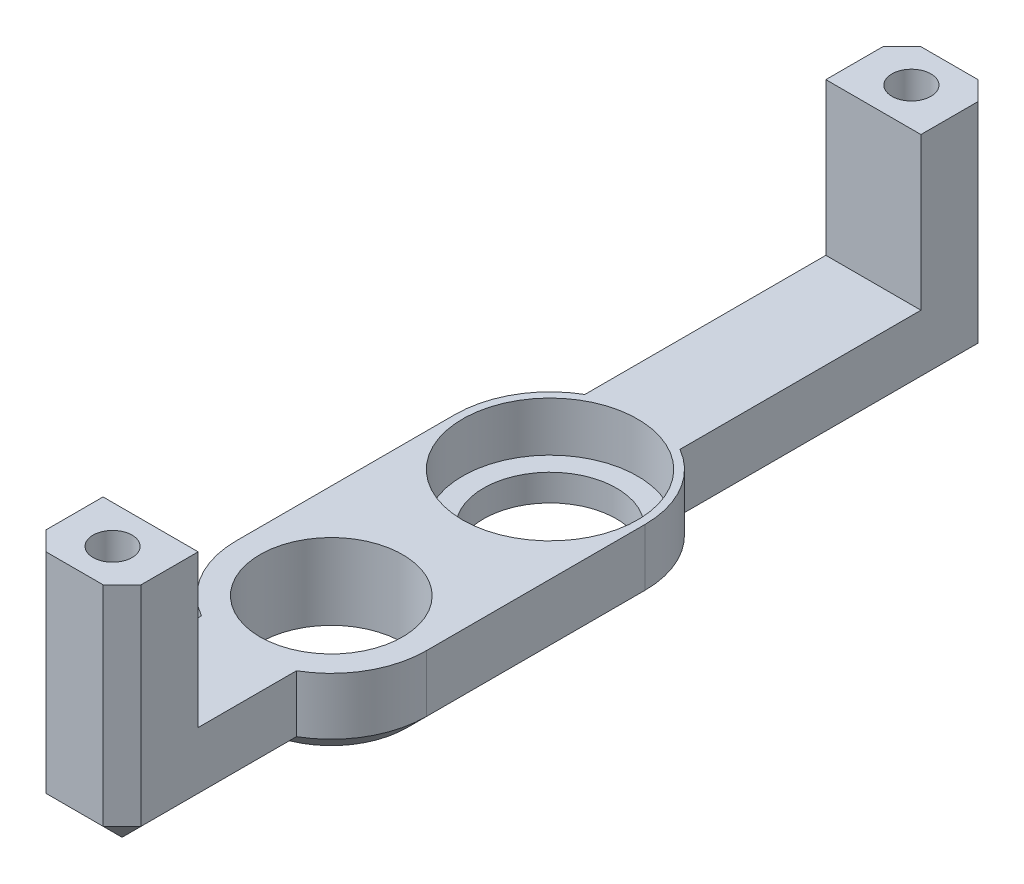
ISO-10303-21;
HEADER;
FILE_DESCRIPTION(('STEP AP214'),'2;1');
FILE_NAME('part.step','',(''),(''),'','','');
FILE_SCHEMA(('AUTOMOTIVE_DESIGN { 1 0 10303 214 1 1 1 1 }'));
ENDSEC;
DATA;
#1=APPLICATION_CONTEXT('core data for automotive mechanical design processes');
#2=APPLICATION_PROTOCOL_DEFINITION('international standard','automotive_design',2000,#1);
#3=PRODUCT_CONTEXT('',#1,'mechanical');
#4=PRODUCT('Part','Part','',(#3));
#5=PRODUCT_RELATED_PRODUCT_CATEGORY('part','',(#4));
#6=PRODUCT_DEFINITION_FORMATION('','',#4);
#7=PRODUCT_DEFINITION_CONTEXT('part definition',#1,'design');
#8=PRODUCT_DEFINITION('design','',#6,#7);
#9=PRODUCT_DEFINITION_SHAPE('','',#8);
#10=(LENGTH_UNIT() NAMED_UNIT(*) SI_UNIT(.MILLI.,.METRE.));
#11=(NAMED_UNIT(*) PLANE_ANGLE_UNIT() SI_UNIT($,.RADIAN.));
#12=(NAMED_UNIT(*) SI_UNIT($,.STERADIAN.) SOLID_ANGLE_UNIT());
#13=UNCERTAINTY_MEASURE_WITH_UNIT(LENGTH_MEASURE(1.E-05),#10,'distance_accuracy_value','');
#14=(GEOMETRIC_REPRESENTATION_CONTEXT(3) GLOBAL_UNCERTAINTY_ASSIGNED_CONTEXT((#13)) GLOBAL_UNIT_ASSIGNED_CONTEXT((#10,
#11,#12)) REPRESENTATION_CONTEXT('',''));
#15=CARTESIAN_POINT('',(0.,0.,0.));
#16=DIRECTION('',(0.,0.,1.));
#17=DIRECTION('',(1.,0.,0.));
#18=AXIS2_PLACEMENT_3D('',#15,#16,#17);
#19=CARTESIAN_POINT('',(0.,4.,0.));
#20=DIRECTION('',(0.,-1.,0.));
#21=DIRECTION('',(0.,0.,-1.));
#22=AXIS2_PLACEMENT_3D('',#19,#20,#21);
#23=PLANE('',#22);
#24=CARTESIAN_POINT('',(5.,4.,-25.));
#25=DIRECTION('',(0.,1.,0.));
#26=DIRECTION('',(0.,0.,1.));
#27=AXIS2_PLACEMENT_3D('',#24,#25,#26);
#28=CIRCLE('',#27,4.6);
#29=CARTESIAN_POINT('',(5.,4.,-20.4));
#30=VERTEX_POINT('',#29);
#31=EDGE_CURVE('E888',#30,#30,#28,.T.);
#32=ORIENTED_EDGE('',*,*,#31,.F.);
#33=EDGE_LOOP('',(#32));
#34=FACE_BOUND('',#33,.T.);
#35=CARTESIAN_POINT('',(5.,4.,-13.5));
#36=DIRECTION('',(0.,1.,0.));
#37=DIRECTION('',(0.,0.,1.));
#38=AXIS2_PLACEMENT_3D('',#35,#36,#37);
#39=CIRCLE('',#38,3.75);
#40=CARTESIAN_POINT('',(5.,4.,-9.75));
#41=VERTEX_POINT('',#40);
#42=EDGE_CURVE('E312',#41,#41,#39,.T.);
#43=ORIENTED_EDGE('',*,*,#42,.F.);
#44=EDGE_LOOP('',(#43));
#45=FACE_BOUND('',#44,.T.);
#46=DIRECTION('',(-1.,0.,0.));
#47=VECTOR('',#46,1.);
#48=CARTESIAN_POINT('',(2.5,4.,-4.));
#49=LINE('',#48,#47);
#50=CARTESIAN_POINT('',(7.5,4.,-4.));
#51=VERTEX_POINT('',#50);
#52=CARTESIAN_POINT('',(2.5,4.,-4.));
#53=VERTEX_POINT('',#52);
#54=EDGE_CURVE('E252',#51,#53,#49,.T.);
#55=ORIENTED_EDGE('',*,*,#54,.F.);
#56=DIRECTION('',(0.,0.,1.));
#57=VECTOR('',#56,1.);
#58=CARTESIAN_POINT('',(7.5,4.,0.));
#59=LINE('',#58,#57);
#60=CARTESIAN_POINT('',(7.5,4.,-9.16987298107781));
#61=VERTEX_POINT('',#60);
#62=EDGE_CURVE('E318',#61,#51,#59,.T.);
#63=ORIENTED_EDGE('',*,*,#62,.F.);
#64=CARTESIAN_POINT('',(5.,4.,-13.5));
#65=DIRECTION('',(0.,-1.,0.));
#66=DIRECTION('',(0.,0.,1.));
#67=AXIS2_PLACEMENT_3D('',#64,#65,#66);
#68=CIRCLE('',#67,5.);
#69=CARTESIAN_POINT('',(10.,4.,-13.5));
#70=VERTEX_POINT('',#69);
#71=EDGE_CURVE('E298',#70,#61,#68,.T.);
#72=ORIENTED_EDGE('',*,*,#71,.F.);
#73=DIRECTION('',(0.,0.,-1.));
#74=VECTOR('',#73,1.);
#75=CARTESIAN_POINT('',(9.99999999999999,4.,-46.));
#76=LINE('',#75,#74);
#77=CARTESIAN_POINT('',(10.,4.,-25.));
#78=VERTEX_POINT('',#77);
#79=EDGE_CURVE('E348',#70,#78,#76,.T.);
#80=ORIENTED_EDGE('',*,*,#79,.T.);
#81=CARTESIAN_POINT('',(5.,4.,-25.));
#82=DIRECTION('',(0.,-1.,0.));
#83=DIRECTION('',(0.,0.,1.));
#84=AXIS2_PLACEMENT_3D('',#81,#82,#83);
#85=CIRCLE('',#84,5.);
#86=CARTESIAN_POINT('',(7.5,4.,-29.3301270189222));
#87=VERTEX_POINT('',#86);
#88=EDGE_CURVE('E339',#87,#78,#85,.T.);
#89=ORIENTED_EDGE('',*,*,#88,.F.);
#90=DIRECTION('',(0.,0.,1.));
#91=VECTOR('',#90,1.);
#92=CARTESIAN_POINT('',(7.49999999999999,4.,-46.));
#93=LINE('',#92,#91);
#94=CARTESIAN_POINT('',(7.49999999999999,4.,-42.));
#95=VERTEX_POINT('',#94);
#96=EDGE_CURVE('E335',#95,#87,#93,.T.);
#97=ORIENTED_EDGE('',*,*,#96,.F.);
#98=DIRECTION('',(1.,0.,0.));
#99=VECTOR('',#98,1.);
#100=CARTESIAN_POINT('',(2.49999999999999,4.,-42.));
#101=LINE('',#100,#99);
#102=CARTESIAN_POINT('',(2.49999999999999,4.,-42.));
#103=VERTEX_POINT('',#102);
#104=EDGE_CURVE('E272',#103,#95,#101,.T.);
#105=ORIENTED_EDGE('',*,*,#104,.F.);
#106=DIRECTION('',(0.,0.,-1.));
#107=VECTOR('',#106,1.);
#108=CARTESIAN_POINT('',(2.49999999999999,4.,-46.));
#109=LINE('',#108,#107);
#110=CARTESIAN_POINT('',(2.49999999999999,4.,-29.3301270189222));
#111=VERTEX_POINT('',#110);
#112=EDGE_CURVE('E354',#111,#103,#109,.T.);
#113=ORIENTED_EDGE('',*,*,#112,.F.);
#114=CARTESIAN_POINT('',(5.,4.,-25.));
#115=DIRECTION('',(0.,-1.,0.));
#116=DIRECTION('',(0.,0.,1.));
#117=AXIS2_PLACEMENT_3D('',#114,#115,#116);
#118=CIRCLE('',#117,5.);
#119=CARTESIAN_POINT('',(0.,4.,-25.));
#120=VERTEX_POINT('',#119);
#121=EDGE_CURVE('E334',#120,#111,#118,.T.);
#122=ORIENTED_EDGE('',*,*,#121,.F.);
#123=DIRECTION('',(0.,0.,1.));
#124=VECTOR('',#123,1.);
#125=CARTESIAN_POINT('',(0.,4.,0.));
#126=LINE('',#125,#124);
#127=CARTESIAN_POINT('',(0.,4.,-13.5));
#128=VERTEX_POINT('',#127);
#129=EDGE_CURVE('E366',#120,#128,#126,.T.);
#130=ORIENTED_EDGE('',*,*,#129,.T.);
#131=CARTESIAN_POINT('',(5.,4.,-13.5));
#132=DIRECTION('',(0.,-1.,0.));
#133=DIRECTION('',(0.,0.,1.));
#134=AXIS2_PLACEMENT_3D('',#131,#132,#133);
#135=CIRCLE('',#134,5.);
#136=CARTESIAN_POINT('',(2.5,4.,-9.16987298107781));
#137=VERTEX_POINT('',#136);
#138=EDGE_CURVE('E299',#137,#128,#135,.T.);
#139=ORIENTED_EDGE('',*,*,#138,.F.);
#140=DIRECTION('',(0.,0.,-1.));
#141=VECTOR('',#140,1.);
#142=CARTESIAN_POINT('',(2.5,4.,0.));
#143=LINE('',#142,#141);
#144=EDGE_CURVE('E303',#53,#137,#143,.T.);
#145=ORIENTED_EDGE('',*,*,#144,.F.);
#146=EDGE_LOOP('',(#55,#63,#72,#80,#89,#97,#105,#113,#122,#130,#139,#145));
#147=FACE_BOUND('',#146,.T.);
#148=ADVANCED_FACE('F41',(#34,#45,#147),#23,.F.);
#149=CARTESIAN_POINT('',(0.,4.,0.));
#150=DIRECTION('',(1.,0.,0.));
#151=DIRECTION('',(0.,0.,-1.));
#152=AXIS2_PLACEMENT_3D('',#149,#150,#151);
#153=PLANE('',#152);
#154=DIRECTION('',(0.,1.,0.));
#155=VECTOR('',#154,1.);
#156=CARTESIAN_POINT('',(0.,0.,-25.));
#157=LINE('',#156,#155);
#158=CARTESIAN_POINT('',(0.,1.,-25.));
#159=VERTEX_POINT('',#158);
#160=EDGE_CURVE('E358',#159,#120,#157,.T.);
#161=ORIENTED_EDGE('',*,*,#160,.F.);
#162=DIRECTION('',(0.,0.,1.));
#163=VECTOR('',#162,1.);
#164=CARTESIAN_POINT('',(0.,0.999999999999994,-13.5));
#165=LINE('',#164,#163);
#166=CARTESIAN_POINT('',(0.,0.999999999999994,-13.5));
#167=VERTEX_POINT('',#166);
#168=EDGE_CURVE('E468',#159,#167,#165,.T.);
#169=ORIENTED_EDGE('',*,*,#168,.T.);
#170=DIRECTION('',(0.,1.,0.));
#171=VECTOR('',#170,1.);
#172=CARTESIAN_POINT('',(0.,0.,-13.5));
#173=LINE('',#172,#171);
#174=EDGE_CURVE('E308',#167,#128,#173,.T.);
#175=ORIENTED_EDGE('',*,*,#174,.T.);
#176=ORIENTED_EDGE('',*,*,#129,.F.);
#177=EDGE_LOOP('',(#161,#169,#175,#176));
#178=FACE_BOUND('',#177,.T.);
#179=ADVANCED_FACE('F768',(#178),#153,.F.);
#180=CARTESIAN_POINT('',(9.99999999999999,4.,-46.));
#181=DIRECTION('',(-1.,0.,0.));
#182=DIRECTION('',(0.,0.,1.));
#183=AXIS2_PLACEMENT_3D('',#180,#181,#182);
#184=PLANE('',#183);
#185=DIRECTION('',(0.,1.,0.));
#186=VECTOR('',#185,1.);
#187=CARTESIAN_POINT('',(10.,0.,-13.5));
#188=LINE('',#187,#186);
#189=CARTESIAN_POINT('',(10.,0.999999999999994,-13.5));
#190=VERTEX_POINT('',#189);
#191=EDGE_CURVE('E322',#190,#70,#188,.T.);
#192=ORIENTED_EDGE('',*,*,#191,.F.);
#193=DIRECTION('',(0.,0.,-1.));
#194=VECTOR('',#193,1.);
#195=CARTESIAN_POINT('',(10.,0.999999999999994,-25.));
#196=LINE('',#195,#194);
#197=CARTESIAN_POINT('',(10.,1.,-25.));
#198=VERTEX_POINT('',#197);
#199=EDGE_CURVE('E438',#190,#198,#196,.T.);
#200=ORIENTED_EDGE('',*,*,#199,.T.);
#201=DIRECTION('',(0.,1.,0.));
#202=VECTOR('',#201,1.);
#203=CARTESIAN_POINT('',(10.,0.,-25.));
#204=LINE('',#203,#202);
#205=EDGE_CURVE('E345',#198,#78,#204,.T.);
#206=ORIENTED_EDGE('',*,*,#205,.T.);
#207=ORIENTED_EDGE('',*,*,#79,.F.);
#208=EDGE_LOOP('',(#192,#200,#206,#207));
#209=FACE_BOUND('',#208,.T.);
#210=ADVANCED_FACE('F774',(#209),#184,.F.);
#211=CARTESIAN_POINT('',(10.,4.,0.));
#212=DIRECTION('',(0.,0.,-1.));
#213=DIRECTION('',(-1.,0.,0.));
#214=AXIS2_PLACEMENT_3D('',#211,#212,#213);
#215=PLANE('',#214);
#216=DIRECTION('',(1.,0.,0.));
#217=VECTOR('',#216,1.);
#218=CARTESIAN_POINT('',(2.5,12.,0.));
#219=LINE('',#218,#217);
#220=CARTESIAN_POINT('',(3.5,12.,0.));
#221=VERTEX_POINT('',#220);
#222=CARTESIAN_POINT('',(6.50000000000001,12.,0.));
#223=VERTEX_POINT('',#222);
#224=EDGE_CURVE('E251',#221,#223,#219,.T.);
#225=ORIENTED_EDGE('',*,*,#224,.F.);
#226=DIRECTION('',(0.,-1.,0.));
#227=VECTOR('',#226,1.);
#228=CARTESIAN_POINT('',(3.5,4.,0.));
#229=LINE('',#228,#227);
#230=CARTESIAN_POINT('',(3.5,0.999999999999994,0.));
#231=VERTEX_POINT('',#230);
#232=EDGE_CURVE('E426',#221,#231,#229,.T.);
#233=ORIENTED_EDGE('',*,*,#232,.T.);
#234=DIRECTION('',(1.,0.,0.));
#235=VECTOR('',#234,1.);
#236=CARTESIAN_POINT('',(7.5,0.999999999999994,0.));
#237=LINE('',#236,#235);
#238=CARTESIAN_POINT('',(6.50000000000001,0.999999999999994,0.));
#239=VERTEX_POINT('',#238);
#240=EDGE_CURVE('E423',#231,#239,#237,.T.);
#241=ORIENTED_EDGE('',*,*,#240,.T.);
#242=DIRECTION('',(0.,1.,0.));
#243=VECTOR('',#242,1.);
#244=CARTESIAN_POINT('',(6.50000000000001,4.,0.));
#245=LINE('',#244,#243);
#246=EDGE_CURVE('E420',#239,#223,#245,.T.);
#247=ORIENTED_EDGE('',*,*,#246,.T.);
#248=EDGE_LOOP('',(#225,#233,#241,#247));
#249=FACE_BOUND('',#248,.T.);
#250=ADVANCED_FACE('F790',(#249),#215,.F.);
#251=CARTESIAN_POINT('',(0.,4.,-46.));
#252=DIRECTION('',(0.,0.,1.));
#253=DIRECTION('',(1.,0.,0.));
#254=AXIS2_PLACEMENT_3D('',#251,#252,#253);
#255=PLANE('',#254);
#256=DIRECTION('',(-1.,0.,0.));
#257=VECTOR('',#256,1.);
#258=CARTESIAN_POINT('',(2.49999999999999,12.,-46.));
#259=LINE('',#258,#257);
#260=CARTESIAN_POINT('',(6.5,12.,-46.));
#261=VERTEX_POINT('',#260);
#262=CARTESIAN_POINT('',(3.49999999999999,12.,-46.));
#263=VERTEX_POINT('',#262);
#264=EDGE_CURVE('E283',#261,#263,#259,.T.);
#265=ORIENTED_EDGE('',*,*,#264,.F.);
#266=DIRECTION('',(0.,-1.,0.));
#267=VECTOR('',#266,1.);
#268=CARTESIAN_POINT('',(6.5,4.,-46.));
#269=LINE('',#268,#267);
#270=CARTESIAN_POINT('',(6.5,0.999999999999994,-46.));
#271=VERTEX_POINT('',#270);
#272=EDGE_CURVE('E462',#261,#271,#269,.T.);
#273=ORIENTED_EDGE('',*,*,#272,.T.);
#274=DIRECTION('',(-1.,0.,0.));
#275=VECTOR('',#274,1.);
#276=CARTESIAN_POINT('',(2.49999999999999,0.999999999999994,-46.));
#277=LINE('',#276,#275);
#278=CARTESIAN_POINT('',(3.49999999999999,0.999999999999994,-46.));
#279=VERTEX_POINT('',#278);
#280=EDGE_CURVE('E459',#271,#279,#277,.T.);
#281=ORIENTED_EDGE('',*,*,#280,.T.);
#282=DIRECTION('',(0.,1.,0.));
#283=VECTOR('',#282,1.);
#284=CARTESIAN_POINT('',(3.49999999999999,4.,-46.));
#285=LINE('',#284,#283);
#286=EDGE_CURVE('E456',#279,#263,#285,.T.);
#287=ORIENTED_EDGE('',*,*,#286,.T.);
#288=EDGE_LOOP('',(#265,#273,#281,#287));
#289=FACE_BOUND('',#288,.T.);
#290=ADVANCED_FACE('F785',(#289),#255,.F.);
#291=CARTESIAN_POINT('',(0.,0.,0.));
#292=DIRECTION('',(0.,-1.,0.));
#293=DIRECTION('',(0.,0.,-1.));
#294=AXIS2_PLACEMENT_3D('',#291,#292,#293);
#295=PLANE('',#294);
#296=CARTESIAN_POINT('',(5.,0.,-25.));
#297=DIRECTION('',(0.,1.,0.));
#298=DIRECTION('',(0.,0.,1.));
#299=AXIS2_PLACEMENT_3D('',#296,#297,#298);
#300=CIRCLE('',#299,3.5);
#301=CARTESIAN_POINT('',(5.,0.,-21.5));
#302=VERTEX_POINT('',#301);
#303=EDGE_CURVE('E884',#302,#302,#300,.T.);
#304=ORIENTED_EDGE('',*,*,#303,.T.);
#305=EDGE_LOOP('',(#304));
#306=FACE_BOUND('',#305,.T.);
#307=DIRECTION('',(-1.,0.,0.));
#308=VECTOR('',#307,1.);
#309=CARTESIAN_POINT('',(2.5,0.,-1.));
#310=LINE('',#309,#308);
#311=CARTESIAN_POINT('',(6.50000000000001,0.,-1.));
#312=VERTEX_POINT('',#311);
#313=CARTESIAN_POINT('',(3.49999999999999,0.,-1.));
#314=VERTEX_POINT('',#313);
#315=EDGE_CURVE('E400',#312,#314,#310,.T.);
#316=ORIENTED_EDGE('',*,*,#315,.T.);
#317=DIRECTION('',(0.,0.,-1.));
#318=VECTOR('',#317,1.);
#319=CARTESIAN_POINT('',(3.49999999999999,0.,-9.16987298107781));
#320=LINE('',#319,#318);
#321=CARTESIAN_POINT('',(3.49999999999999,0.,-9.79190075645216));
#322=VERTEX_POINT('',#321);
#323=EDGE_CURVE('E403',#314,#322,#320,.T.);
#324=ORIENTED_EDGE('',*,*,#323,.T.);
#325=CARTESIAN_POINT('',(5.,0.,-13.5));
#326=DIRECTION('',(0.,-1.,0.));
#327=DIRECTION('',(0.,0.,-1.));
#328=AXIS2_PLACEMENT_3D('',#325,#326,#327);
#329=CIRCLE('',#328,4.);
#330=CARTESIAN_POINT('',(1.,0.,-13.5));
#331=VERTEX_POINT('',#330);
#332=EDGE_CURVE('E379',#322,#331,#329,.T.);
#333=ORIENTED_EDGE('',*,*,#332,.T.);
#334=DIRECTION('',(0.,0.,-1.));
#335=VECTOR('',#334,1.);
#336=CARTESIAN_POINT('',(1.,0.,-25.));
#337=LINE('',#336,#335);
#338=CARTESIAN_POINT('',(0.999999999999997,0.,-25.));
#339=VERTEX_POINT('',#338);
#340=EDGE_CURVE('E376',#331,#339,#337,.T.);
#341=ORIENTED_EDGE('',*,*,#340,.T.);
#342=CARTESIAN_POINT('',(5.,0.,-25.));
#343=DIRECTION('',(0.,-1.,0.));
#344=DIRECTION('',(0.,0.,-1.));
#345=AXIS2_PLACEMENT_3D('',#342,#343,#344);
#346=CIRCLE('',#345,4.);
#347=CARTESIAN_POINT('',(3.49999999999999,0.,-28.7080992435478));
#348=VERTEX_POINT('',#347);
#349=EDGE_CURVE('E373',#339,#348,#346,.T.);
#350=ORIENTED_EDGE('',*,*,#349,.T.);
#351=DIRECTION('',(0.,0.,-1.));
#352=VECTOR('',#351,1.);
#353=CARTESIAN_POINT('',(3.49999999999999,0.,-46.));
#354=LINE('',#353,#352);
#355=CARTESIAN_POINT('',(3.49999999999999,0.,-45.));
#356=VERTEX_POINT('',#355);
#357=EDGE_CURVE('E370',#348,#356,#354,.T.);
#358=ORIENTED_EDGE('',*,*,#357,.T.);
#359=DIRECTION('',(1.,0.,0.));
#360=VECTOR('',#359,1.);
#361=CARTESIAN_POINT('',(7.49999999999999,0.,-45.));
#362=LINE('',#361,#360);
#363=CARTESIAN_POINT('',(6.5,0.,-45.));
#364=VERTEX_POINT('',#363);
#365=EDGE_CURVE('E382',#356,#364,#362,.T.);
#366=ORIENTED_EDGE('',*,*,#365,.T.);
#367=DIRECTION('',(0.,0.,1.));
#368=VECTOR('',#367,1.);
#369=CARTESIAN_POINT('',(6.50000000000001,0.,-29.3301270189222));
#370=LINE('',#369,#368);
#371=CARTESIAN_POINT('',(6.50000000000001,0.,-28.7080992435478));
#372=VERTEX_POINT('',#371);
#373=EDGE_CURVE('E385',#364,#372,#370,.T.);
#374=ORIENTED_EDGE('',*,*,#373,.T.);
#375=CARTESIAN_POINT('',(5.,0.,-25.));
#376=DIRECTION('',(0.,-1.,0.));
#377=DIRECTION('',(0.,0.,-1.));
#378=AXIS2_PLACEMENT_3D('',#375,#376,#377);
#379=CIRCLE('',#378,4.);
#380=CARTESIAN_POINT('',(9.,0.,-25.));
#381=VERTEX_POINT('',#380);
#382=EDGE_CURVE('E388',#372,#381,#379,.T.);
#383=ORIENTED_EDGE('',*,*,#382,.T.);
#384=DIRECTION('',(0.,0.,1.));
#385=VECTOR('',#384,1.);
#386=CARTESIAN_POINT('',(9.,0.,-13.5));
#387=LINE('',#386,#385);
#388=CARTESIAN_POINT('',(9.,0.,-13.5));
#389=VERTEX_POINT('',#388);
#390=EDGE_CURVE('E391',#381,#389,#387,.T.);
#391=ORIENTED_EDGE('',*,*,#390,.T.);
#392=CARTESIAN_POINT('',(5.,0.,-13.5));
#393=DIRECTION('',(0.,-1.,0.));
#394=DIRECTION('',(0.,0.,-1.));
#395=AXIS2_PLACEMENT_3D('',#392,#393,#394);
#396=CIRCLE('',#395,4.00000000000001);
#397=CARTESIAN_POINT('',(6.50000000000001,0.,-9.79190075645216));
#398=VERTEX_POINT('',#397);
#399=EDGE_CURVE('E394',#389,#398,#396,.T.);
#400=ORIENTED_EDGE('',*,*,#399,.T.);
#401=DIRECTION('',(0.,0.,1.));
#402=VECTOR('',#401,1.);
#403=CARTESIAN_POINT('',(6.50000000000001,0.,0.));
#404=LINE('',#403,#402);
#405=EDGE_CURVE('E397',#398,#312,#404,.T.);
#406=ORIENTED_EDGE('',*,*,#405,.T.);
#407=EDGE_LOOP('',(#316,#324,#333,#341,#350,#358,#366,#374,#383,#391,#400,#406));
#408=FACE_BOUND('',#407,.T.);
#409=CARTESIAN_POINT('',(5.,0.,-13.5));
#410=DIRECTION('',(0.,1.,0.));
#411=DIRECTION('',(0.,0.,1.));
#412=AXIS2_PLACEMENT_3D('',#409,#410,#411);
#413=CIRCLE('',#412,3.75);
#414=CARTESIAN_POINT('',(5.,0.,-9.75));
#415=VERTEX_POINT('',#414);
#416=EDGE_CURVE('E330',#415,#415,#413,.T.);
#417=ORIENTED_EDGE('',*,*,#416,.T.);
#418=EDGE_LOOP('',(#417));
#419=FACE_BOUND('',#418,.T.);
#420=ADVANCED_FACE('F680',(#306,#408,#419),#295,.T.);
#421=CARTESIAN_POINT('',(2.49999999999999,0.,-46.));
#422=DIRECTION('',(1.,0.,0.));
#423=DIRECTION('',(0.,0.,-1.));
#424=AXIS2_PLACEMENT_3D('',#421,#422,#423);
#425=PLANE('',#424);
#426=DIRECTION('',(0.,-1.,0.));
#427=VECTOR('',#426,1.);
#428=CARTESIAN_POINT('',(2.49999999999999,0.,-45.));
#429=LINE('',#428,#427);
#430=CARTESIAN_POINT('',(2.49999999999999,12.,-45.));
#431=VERTEX_POINT('',#430);
#432=CARTESIAN_POINT('',(2.49999999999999,1.,-45.));
#433=VERTEX_POINT('',#432);
#434=EDGE_CURVE('E52',#431,#433,#429,.T.);
#435=ORIENTED_EDGE('',*,*,#434,.T.);
#436=DIRECTION('',(0.,0.,1.));
#437=VECTOR('',#436,1.);
#438=CARTESIAN_POINT('',(2.49999999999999,1.,-29.3301270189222));
#439=LINE('',#438,#437);
#440=CARTESIAN_POINT('',(2.49999999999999,1.,-29.3301270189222));
#441=VERTEX_POINT('',#440);
#442=EDGE_CURVE('E11',#433,#441,#439,.T.);
#443=ORIENTED_EDGE('',*,*,#442,.T.);
#444=DIRECTION('',(0.,1.,0.));
#445=VECTOR('',#444,1.);
#446=CARTESIAN_POINT('',(2.49999999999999,0.,-29.3301270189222));
#447=LINE('',#446,#445);
#448=EDGE_CURVE('E340',#441,#111,#447,.T.);
#449=ORIENTED_EDGE('',*,*,#448,.T.);
#450=ORIENTED_EDGE('',*,*,#112,.T.);
#451=DIRECTION('',(0.,-1.,0.));
#452=VECTOR('',#451,1.);
#453=CARTESIAN_POINT('',(2.49999999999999,12.,-42.));
#454=LINE('',#453,#452);
#455=CARTESIAN_POINT('',(2.49999999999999,12.,-42.));
#456=VERTEX_POINT('',#455);
#457=EDGE_CURVE('E294',#456,#103,#454,.T.);
#458=ORIENTED_EDGE('',*,*,#457,.F.);
#459=DIRECTION('',(0.,0.,1.));
#460=VECTOR('',#459,1.);
#461=CARTESIAN_POINT('',(2.49999999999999,12.,-46.));
#462=LINE('',#461,#460);
#463=EDGE_CURVE('E273',#431,#456,#462,.T.);
#464=ORIENTED_EDGE('',*,*,#463,.F.);
#465=EDGE_LOOP('',(#435,#443,#449,#450,#458,#464));
#466=FACE_BOUND('',#465,.T.);
#467=ADVANCED_FACE('F784',(#466),#425,.F.);
#468=CARTESIAN_POINT('',(5.,0.,-25.));
#469=DIRECTION('',(0.,1.,0.));
#470=DIRECTION('',(0.,0.,1.));
#471=AXIS2_PLACEMENT_3D('',#468,#469,#470);
#472=CYLINDRICAL_SURFACE('',#471,5.);
#473=ORIENTED_EDGE('',*,*,#448,.F.);
#474=CARTESIAN_POINT('',(5.,1.,-25.));
#475=DIRECTION('',(0.,-1.,0.));
#476=DIRECTION('',(0.,0.,-1.));
#477=AXIS2_PLACEMENT_3D('',#474,#475,#476);
#478=CIRCLE('',#477,5.);
#479=EDGE_CURVE('E471',#441,#159,#478,.F.);
#480=ORIENTED_EDGE('',*,*,#479,.T.);
#481=ORIENTED_EDGE('',*,*,#160,.T.);
#482=ORIENTED_EDGE('',*,*,#121,.T.);
#483=EDGE_LOOP('',(#473,#480,#481,#482));
#484=FACE_BOUND('',#483,.T.);
#485=ADVANCED_FACE('F781',(#484),#472,.T.);
#486=CARTESIAN_POINT('',(5.,0.,-25.));
#487=DIRECTION('',(0.,1.,0.));
#488=DIRECTION('',(0.,0.,1.));
#489=AXIS2_PLACEMENT_3D('',#486,#487,#488);
#490=CYLINDRICAL_SURFACE('',#489,5.);
#491=ORIENTED_EDGE('',*,*,#205,.F.);
#492=CARTESIAN_POINT('',(5.,1.,-25.));
#493=DIRECTION('',(0.,-1.,0.));
#494=DIRECTION('',(0.,0.,-1.));
#495=AXIS2_PLACEMENT_3D('',#492,#493,#494);
#496=CIRCLE('',#495,5.);
#497=CARTESIAN_POINT('',(7.5,1.,-29.3301270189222));
#498=VERTEX_POINT('',#497);
#499=EDGE_CURVE('E441',#198,#498,#496,.F.);
#500=ORIENTED_EDGE('',*,*,#499,.T.);
#501=DIRECTION('',(0.,1.,0.));
#502=VECTOR('',#501,1.);
#503=CARTESIAN_POINT('',(7.5,0.,-29.3301270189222));
#504=LINE('',#503,#502);
#505=EDGE_CURVE('E344',#498,#87,#504,.T.);
#506=ORIENTED_EDGE('',*,*,#505,.T.);
#507=ORIENTED_EDGE('',*,*,#88,.T.);
#508=EDGE_LOOP('',(#491,#500,#506,#507));
#509=FACE_BOUND('',#508,.T.);
#510=ADVANCED_FACE('F711',(#509),#490,.T.);
#511=CARTESIAN_POINT('',(7.49999999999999,0.,-46.));
#512=DIRECTION('',(-1.,0.,0.));
#513=DIRECTION('',(0.,0.,1.));
#514=AXIS2_PLACEMENT_3D('',#511,#512,#513);
#515=PLANE('',#514);
#516=ORIENTED_EDGE('',*,*,#505,.F.);
#517=DIRECTION('',(0.,0.,-1.));
#518=VECTOR('',#517,1.);
#519=CARTESIAN_POINT('',(7.49999999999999,1.,-46.));
#520=LINE('',#519,#518);
#521=CARTESIAN_POINT('',(7.49999999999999,1.,-45.));
#522=VERTEX_POINT('',#521);
#523=EDGE_CURVE('E447',#498,#522,#520,.T.);
#524=ORIENTED_EDGE('',*,*,#523,.T.);
#525=DIRECTION('',(0.,1.,0.));
#526=VECTOR('',#525,1.);
#527=CARTESIAN_POINT('',(7.49999999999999,0.,-45.));
#528=LINE('',#527,#526);
#529=CARTESIAN_POINT('',(7.49999999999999,12.,-45.));
#530=VERTEX_POINT('',#529);
#531=EDGE_CURVE('E444',#522,#530,#528,.T.);
#532=ORIENTED_EDGE('',*,*,#531,.T.);
#533=DIRECTION('',(0.,0.,-1.));
#534=VECTOR('',#533,1.);
#535=CARTESIAN_POINT('',(7.49999999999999,12.,-46.));
#536=LINE('',#535,#534);
#537=CARTESIAN_POINT('',(7.49999999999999,12.,-42.));
#538=VERTEX_POINT('',#537);
#539=EDGE_CURVE('E279',#538,#530,#536,.T.);
#540=ORIENTED_EDGE('',*,*,#539,.F.);
#541=DIRECTION('',(0.,-1.,0.));
#542=VECTOR('',#541,1.);
#543=CARTESIAN_POINT('',(7.49999999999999,12.,-42.));
#544=LINE('',#543,#542);
#545=EDGE_CURVE('E287',#538,#95,#544,.T.);
#546=ORIENTED_EDGE('',*,*,#545,.T.);
#547=ORIENTED_EDGE('',*,*,#96,.T.);
#548=EDGE_LOOP('',(#516,#524,#532,#540,#546,#547));
#549=FACE_BOUND('',#548,.T.);
#550=ADVANCED_FACE('F696',(#549),#515,.F.);
#551=CARTESIAN_POINT('',(5.,4.,-13.5));
#552=DIRECTION('',(0.,1.,0.));
#553=DIRECTION('',(0.,0.,1.));
#554=AXIS2_PLACEMENT_3D('',#551,#552,#553);
#555=CYLINDRICAL_SURFACE('',#554,3.75);
#556=ORIENTED_EDGE('',*,*,#416,.F.);
#557=EDGE_LOOP('',(#556));
#558=FACE_BOUND('',#557,.T.);
#559=ORIENTED_EDGE('',*,*,#42,.T.);
#560=EDGE_LOOP('',(#559));
#561=FACE_BOUND('',#560,.T.);
#562=ADVANCED_FACE('F826',(#558,#561),#555,.F.);
#563=CARTESIAN_POINT('',(7.5,0.,0.));
#564=DIRECTION('',(-1.,0.,0.));
#565=DIRECTION('',(0.,0.,1.));
#566=AXIS2_PLACEMENT_3D('',#563,#564,#565);
#567=PLANE('',#566);
#568=DIRECTION('',(0.,0.,-1.));
#569=VECTOR('',#568,1.);
#570=CARTESIAN_POINT('',(7.5,12.,0.));
#571=LINE('',#570,#569);
#572=CARTESIAN_POINT('',(7.5,12.,-1.));
#573=VERTEX_POINT('',#572);
#574=CARTESIAN_POINT('',(7.5,12.,-4.));
#575=VERTEX_POINT('',#574);
#576=EDGE_CURVE('E256',#573,#575,#571,.T.);
#577=ORIENTED_EDGE('',*,*,#576,.F.);
#578=DIRECTION('',(0.,-1.,0.));
#579=VECTOR('',#578,1.);
#580=CARTESIAN_POINT('',(7.5,0.,-1.));
#581=LINE('',#580,#579);
#582=CARTESIAN_POINT('',(7.5,1.,-1.));
#583=VERTEX_POINT('',#582);
#584=EDGE_CURVE('E432',#573,#583,#581,.T.);
#585=ORIENTED_EDGE('',*,*,#584,.T.);
#586=DIRECTION('',(0.,0.,-1.));
#587=VECTOR('',#586,1.);
#588=CARTESIAN_POINT('',(7.5,1.,-9.16987298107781));
#589=LINE('',#588,#587);
#590=CARTESIAN_POINT('',(7.5,1.,-9.16987298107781));
#591=VERTEX_POINT('',#590);
#592=EDGE_CURVE('E429',#583,#591,#589,.T.);
#593=ORIENTED_EDGE('',*,*,#592,.T.);
#594=DIRECTION('',(0.,1.,0.));
#595=VECTOR('',#594,1.);
#596=CARTESIAN_POINT('',(7.5,0.,-9.16987298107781));
#597=LINE('',#596,#595);
#598=EDGE_CURVE('E304',#591,#61,#597,.T.);
#599=ORIENTED_EDGE('',*,*,#598,.T.);
#600=ORIENTED_EDGE('',*,*,#62,.T.);
#601=DIRECTION('',(0.,-1.,0.));
#602=VECTOR('',#601,1.);
#603=CARTESIAN_POINT('',(7.5,12.,-4.));
#604=LINE('',#603,#602);
#605=EDGE_CURVE('E269',#575,#51,#604,.T.);
#606=ORIENTED_EDGE('',*,*,#605,.F.);
#607=EDGE_LOOP('',(#577,#585,#593,#599,#600,#606));
#608=FACE_BOUND('',#607,.T.);
#609=ADVANCED_FACE('F831',(#608),#567,.F.);
#610=CARTESIAN_POINT('',(5.,0.,-13.5));
#611=DIRECTION('',(0.,1.,0.));
#612=DIRECTION('',(0.,0.,1.));
#613=AXIS2_PLACEMENT_3D('',#610,#611,#612);
#614=CYLINDRICAL_SURFACE('',#613,5.);
#615=ORIENTED_EDGE('',*,*,#598,.F.);
#616=CARTESIAN_POINT('',(5.,1.,-13.5));
#617=DIRECTION('',(0.,-1.,0.));
#618=DIRECTION('',(0.,0.,-1.));
#619=AXIS2_PLACEMENT_3D('',#616,#617,#618);
#620=CIRCLE('',#619,5.);
#621=EDGE_CURVE('E435',#591,#190,#620,.F.);
#622=ORIENTED_EDGE('',*,*,#621,.T.);
#623=ORIENTED_EDGE('',*,*,#191,.T.);
#624=ORIENTED_EDGE('',*,*,#71,.T.);
#625=EDGE_LOOP('',(#615,#622,#623,#624));
#626=FACE_BOUND('',#625,.T.);
#627=ADVANCED_FACE('F833',(#626),#614,.T.);
#628=CARTESIAN_POINT('',(5.,0.,-13.5));
#629=DIRECTION('',(0.,1.,0.));
#630=DIRECTION('',(0.,0.,1.));
#631=AXIS2_PLACEMENT_3D('',#628,#629,#630);
#632=CYLINDRICAL_SURFACE('',#631,5.);
#633=ORIENTED_EDGE('',*,*,#174,.F.);
#634=CARTESIAN_POINT('',(5.,1.,-13.5));
#635=DIRECTION('',(0.,-1.,0.));
#636=DIRECTION('',(0.,0.,-1.));
#637=AXIS2_PLACEMENT_3D('',#634,#635,#636);
#638=CIRCLE('',#637,5.);
#639=CARTESIAN_POINT('',(2.5,1.,-9.16987298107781));
#640=VERTEX_POINT('',#639);
#641=EDGE_CURVE('E465',#167,#640,#638,.F.);
#642=ORIENTED_EDGE('',*,*,#641,.T.);
#643=DIRECTION('',(0.,1.,0.));
#644=VECTOR('',#643,1.);
#645=CARTESIAN_POINT('',(2.5,0.,-9.16987298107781));
#646=LINE('',#645,#644);
#647=EDGE_CURVE('E309',#640,#137,#646,.T.);
#648=ORIENTED_EDGE('',*,*,#647,.T.);
#649=ORIENTED_EDGE('',*,*,#138,.T.);
#650=EDGE_LOOP('',(#633,#642,#648,#649));
#651=FACE_BOUND('',#650,.T.);
#652=ADVANCED_FACE('F813',(#651),#632,.T.);
#653=CARTESIAN_POINT('',(2.5,0.,0.));
#654=DIRECTION('',(1.,0.,0.));
#655=DIRECTION('',(0.,0.,-1.));
#656=AXIS2_PLACEMENT_3D('',#653,#654,#655);
#657=PLANE('',#656);
#658=ORIENTED_EDGE('',*,*,#647,.F.);
#659=DIRECTION('',(0.,0.,1.));
#660=VECTOR('',#659,1.);
#661=CARTESIAN_POINT('',(2.5,1.,0.));
#662=LINE('',#661,#660);
#663=CARTESIAN_POINT('',(2.5,1.,-0.999999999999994));
#664=VERTEX_POINT('',#663);
#665=EDGE_CURVE('E410',#640,#664,#662,.T.);
#666=ORIENTED_EDGE('',*,*,#665,.T.);
#667=DIRECTION('',(0.,1.,0.));
#668=VECTOR('',#667,1.);
#669=CARTESIAN_POINT('',(2.5,0.,-0.999999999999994));
#670=LINE('',#669,#668);
#671=CARTESIAN_POINT('',(2.5,12.,-0.999999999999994));
#672=VERTEX_POINT('',#671);
#673=EDGE_CURVE('E407',#664,#672,#670,.T.);
#674=ORIENTED_EDGE('',*,*,#673,.T.);
#675=DIRECTION('',(0.,0.,1.));
#676=VECTOR('',#675,1.);
#677=CARTESIAN_POINT('',(2.5,12.,0.));
#678=LINE('',#677,#676);
#679=CARTESIAN_POINT('',(2.5,12.,-4.));
#680=VERTEX_POINT('',#679);
#681=EDGE_CURVE('E247',#680,#672,#678,.T.);
#682=ORIENTED_EDGE('',*,*,#681,.F.);
#683=DIRECTION('',(0.,-1.,0.));
#684=VECTOR('',#683,1.);
#685=CARTESIAN_POINT('',(2.5,12.,-4.));
#686=LINE('',#685,#684);
#687=EDGE_CURVE('E262',#680,#53,#686,.T.);
#688=ORIENTED_EDGE('',*,*,#687,.T.);
#689=ORIENTED_EDGE('',*,*,#144,.T.);
#690=EDGE_LOOP('',(#658,#666,#674,#682,#688,#689));
#691=FACE_BOUND('',#690,.T.);
#692=ADVANCED_FACE('F808',(#691),#657,.F.);
#693=CARTESIAN_POINT('',(2.49999999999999,12.,-42.));
#694=DIRECTION('',(0.,0.,-1.));
#695=DIRECTION('',(-1.,0.,0.));
#696=AXIS2_PLACEMENT_3D('',#693,#694,#695);
#697=PLANE('',#696);
#698=ORIENTED_EDGE('',*,*,#104,.T.);
#699=ORIENTED_EDGE('',*,*,#545,.F.);
#700=DIRECTION('',(1.,0.,0.));
#701=VECTOR('',#700,1.);
#702=CARTESIAN_POINT('',(2.49999999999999,12.,-42.));
#703=LINE('',#702,#701);
#704=EDGE_CURVE('E276',#456,#538,#703,.T.);
#705=ORIENTED_EDGE('',*,*,#704,.F.);
#706=ORIENTED_EDGE('',*,*,#457,.T.);
#707=EDGE_LOOP('',(#698,#699,#705,#706));
#708=FACE_BOUND('',#707,.T.);
#709=ADVANCED_FACE('F703',(#708),#697,.F.);
#710=CARTESIAN_POINT('',(0.,12.,0.));
#711=DIRECTION('',(0.,1.,0.));
#712=DIRECTION('',(0.,0.,1.));
#713=AXIS2_PLACEMENT_3D('',#710,#711,#712);
#714=PLANE('',#713);
#715=CARTESIAN_POINT('',(5.,12.,-44.));
#716=DIRECTION('',(0.,1.,0.));
#717=DIRECTION('',(0.,0.,1.));
#718=AXIS2_PLACEMENT_3D('',#715,#716,#717);
#719=CIRCLE('',#718,1.02499999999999);
#720=CARTESIAN_POINT('',(5.,12.,-42.975));
#721=VERTEX_POINT('',#720);
#722=EDGE_CURVE('E230',#721,#721,#719,.T.);
#723=ORIENTED_EDGE('',*,*,#722,.F.);
#724=EDGE_LOOP('',(#723));
#725=FACE_BOUND('',#724,.T.);
#726=ORIENTED_EDGE('',*,*,#539,.T.);
#727=DIRECTION('',(0.707106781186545,0.,0.70710678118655));
#728=VECTOR('',#727,1.);
#729=CARTESIAN_POINT('',(26.25,12.,-26.2499999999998));
#730=LINE('',#729,#728);
#731=EDGE_CURVE('E453',#530,#261,#730,.F.);
#732=ORIENTED_EDGE('',*,*,#731,.T.);
#733=ORIENTED_EDGE('',*,*,#264,.T.);
#734=DIRECTION('',(0.707106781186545,0.,-0.70710678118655));
#735=VECTOR('',#734,1.);
#736=CARTESIAN_POINT('',(-21.25,12.,-21.2499999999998));
#737=LINE('',#736,#735);
#738=EDGE_CURVE('E450',#263,#431,#737,.F.);
#739=ORIENTED_EDGE('',*,*,#738,.T.);
#740=ORIENTED_EDGE('',*,*,#463,.T.);
#741=ORIENTED_EDGE('',*,*,#704,.T.);
#742=EDGE_LOOP('',(#726,#732,#733,#739,#740,#741));
#743=FACE_BOUND('',#742,.T.);
#744=ADVANCED_FACE('F698',(#725,#743),#714,.T.);
#745=CARTESIAN_POINT('',(2.5,12.,-4.));
#746=DIRECTION('',(0.,0.,1.));
#747=DIRECTION('',(1.,0.,0.));
#748=AXIS2_PLACEMENT_3D('',#745,#746,#747);
#749=PLANE('',#748);
#750=ORIENTED_EDGE('',*,*,#54,.T.);
#751=ORIENTED_EDGE('',*,*,#687,.F.);
#752=DIRECTION('',(-1.,0.,0.));
#753=VECTOR('',#752,1.);
#754=CARTESIAN_POINT('',(2.5,12.,-4.));
#755=LINE('',#754,#753);
#756=EDGE_CURVE('E259',#575,#680,#755,.T.);
#757=ORIENTED_EDGE('',*,*,#756,.F.);
#758=ORIENTED_EDGE('',*,*,#605,.T.);
#759=EDGE_LOOP('',(#750,#751,#757,#758));
#760=FACE_BOUND('',#759,.T.);
#761=ADVANCED_FACE('F848',(#760),#749,.F.);
#762=CARTESIAN_POINT('',(0.,12.,0.));
#763=DIRECTION('',(0.,-1.,0.));
#764=DIRECTION('',(0.,0.,-1.));
#765=AXIS2_PLACEMENT_3D('',#762,#763,#764);
#766=PLANE('',#765);
#767=CARTESIAN_POINT('',(5.,12.,-2.));
#768=DIRECTION('',(0.,1.,0.));
#769=DIRECTION('',(0.,0.,1.));
#770=AXIS2_PLACEMENT_3D('',#767,#768,#769);
#771=CIRCLE('',#770,1.02499999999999);
#772=CARTESIAN_POINT('',(5.,12.,-0.975000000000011));
#773=VERTEX_POINT('',#772);
#774=EDGE_CURVE('E231',#773,#773,#771,.T.);
#775=ORIENTED_EDGE('',*,*,#774,.F.);
#776=EDGE_LOOP('',(#775));
#777=FACE_BOUND('',#776,.T.);
#778=ORIENTED_EDGE('',*,*,#681,.T.);
#779=DIRECTION('',(-0.70710678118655,0.,-0.707106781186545));
#780=VECTOR('',#779,1.);
#781=CARTESIAN_POINT('',(2.5,12.,-0.999999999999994));
#782=LINE('',#781,#780);
#783=EDGE_CURVE('E417',#672,#221,#782,.F.);
#784=ORIENTED_EDGE('',*,*,#783,.T.);
#785=ORIENTED_EDGE('',*,*,#224,.T.);
#786=DIRECTION('',(-0.707106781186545,0.,0.70710678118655));
#787=VECTOR('',#786,1.);
#788=CARTESIAN_POINT('',(6.50000000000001,12.,0.));
#789=LINE('',#788,#787);
#790=EDGE_CURVE('E414',#223,#573,#789,.F.);
#791=ORIENTED_EDGE('',*,*,#790,.T.);
#792=ORIENTED_EDGE('',*,*,#576,.T.);
#793=ORIENTED_EDGE('',*,*,#756,.T.);
#794=EDGE_LOOP('',(#778,#784,#785,#791,#792,#793));
#795=FACE_BOUND('',#794,.T.);
#796=ADVANCED_FACE('F852',(#777,#795),#766,.F.);
#797=CARTESIAN_POINT('',(6.50000000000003,0.,0.));
#798=DIRECTION('',(0.70710678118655,-0.707106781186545,0.));
#799=DIRECTION('',(0.,0.,-1.));
#800=AXIS2_PLACEMENT_3D('',#797,#798,#799);
#801=PLANE('',#800);
#802=DIRECTION('',(-0.707106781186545,-0.70710678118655,0.));
#803=VECTOR('',#802,1.);
#804=CARTESIAN_POINT('',(7.49999999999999,1.,-45.));
#805=LINE('',#804,#803);
#806=EDGE_CURVE('E645',#522,#364,#805,.T.);
#807=ORIENTED_EDGE('',*,*,#806,.F.);
#808=ORIENTED_EDGE('',*,*,#523,.F.);
#809=CARTESIAN_POINT('',(7.5,1.,-29.3301270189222));
#810=CARTESIAN_POINT('',(7.41569932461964,0.915699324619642,-29.2814522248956));
#811=CARTESIAN_POINT('',(7.33159857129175,0.831598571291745,-29.2320797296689));
#812=CARTESIAN_POINT('',(7.16387214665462,0.663872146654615,-29.1318133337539));
#813=CARTESIAN_POINT('',(7.08024638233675,0.580246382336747,-29.0809197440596));
#814=CARTESIAN_POINT('',(6.91350629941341,0.413506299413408,-28.9774626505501));
#815=CARTESIAN_POINT('',(6.83039200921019,0.330392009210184,-28.9248990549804));
#816=CARTESIAN_POINT('',(6.66473992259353,0.164739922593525,-28.817924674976));
#817=CARTESIAN_POINT('',(6.58220224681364,0.0822022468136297,-28.7635135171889));
#818=CARTESIAN_POINT('',(6.50000000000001,0.,-28.7080992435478));
#819=B_SPLINE_CURVE_WITH_KNOTS('',3,(#809,#810,#811,#812,#813,#814,#815,#816,#817,#818),
.UNSPECIFIED.,.F.,.F.,(4,2,2,2,4),(0.,0.386319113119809,0.772559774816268,1.15882169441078,
1.54516213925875),.UNSPECIFIED.);
#820=EDGE_CURVE('E266',#372,#498,#819,.F.);
#821=ORIENTED_EDGE('',*,*,#820,.F.);
#822=ORIENTED_EDGE('',*,*,#373,.F.);
#823=EDGE_LOOP('',(#807,#808,#821,#822));
#824=FACE_BOUND('',#823,.T.);
#825=ADVANCED_FACE('F636',(#824),#801,.T.);
#826=CARTESIAN_POINT('',(7.49999999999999,0.,-45.));
#827=DIRECTION('',(-0.70710678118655,0.,0.707106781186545));
#828=DIRECTION('',(0.,1.,0.));
#829=AXIS2_PLACEMENT_3D('',#826,#827,#828);
#830=PLANE('',#829);
#831=ORIENTED_EDGE('',*,*,#731,.F.);
#832=ORIENTED_EDGE('',*,*,#531,.F.);
#833=DIRECTION('',(-0.707106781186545,0.,-0.70710678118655));
#834=VECTOR('',#833,1.);
#835=CARTESIAN_POINT('',(7.49999999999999,1.,-45.));
#836=LINE('',#835,#834);
#837=EDGE_CURVE('E649',#271,#522,#836,.F.);
#838=ORIENTED_EDGE('',*,*,#837,.F.);
#839=ORIENTED_EDGE('',*,*,#272,.F.);
#840=EDGE_LOOP('',(#831,#832,#838,#839));
#841=FACE_BOUND('',#840,.T.);
#842=ADVANCED_FACE('F44',(#841),#830,.F.);
#843=CARTESIAN_POINT('',(5.,0.,-25.));
#844=DIRECTION('',(0.,1.,0.));
#845=DIRECTION('',(0.,0.,1.));
#846=AXIS2_PLACEMENT_3D('',#843,#844,#845);
#847=CONICAL_SURFACE('',#846,4.,0.785398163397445);
#848=ORIENTED_EDGE('',*,*,#820,.T.);
#849=ORIENTED_EDGE('',*,*,#499,.F.);
#850=DIRECTION('',(0.707106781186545,0.70710678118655,0.));
#851=VECTOR('',#850,1.);
#852=CARTESIAN_POINT('',(9.,0.,-25.));
#853=LINE('',#852,#851);
#854=EDGE_CURVE('E653',#381,#198,#853,.T.);
#855=ORIENTED_EDGE('',*,*,#854,.F.);
#856=ORIENTED_EDGE('',*,*,#382,.F.);
#857=EDGE_LOOP('',(#848,#849,#855,#856));
#858=FACE_BOUND('',#857,.T.);
#859=ADVANCED_FACE('F628',(#858),#847,.T.);
#860=CARTESIAN_POINT('',(7.49999999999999,1.,-45.));
#861=DIRECTION('',(0.57735026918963,-0.577350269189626,-0.577350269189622));
#862=DIRECTION('',(0.707106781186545,0.70710678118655,0.));
#863=AXIS2_PLACEMENT_3D('',#860,#861,#862);
#864=PLANE('',#863);
#865=ORIENTED_EDGE('',*,*,#837,.T.);
#866=ORIENTED_EDGE('',*,*,#806,.T.);
#867=DIRECTION('',(0.,0.707106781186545,-0.70710678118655));
#868=VECTOR('',#867,1.);
#869=CARTESIAN_POINT('',(6.5,0.499999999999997,-45.5));
#870=LINE('',#869,#868);
#871=EDGE_CURVE('E657',#271,#364,#870,.F.);
#872=ORIENTED_EDGE('',*,*,#871,.F.);
#873=EDGE_LOOP('',(#865,#866,#872));
#874=FACE_BOUND('',#873,.T.);
#875=ADVANCED_FACE('F621',(#874),#864,.T.);
#876=CARTESIAN_POINT('',(9.99999999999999,0.999999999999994,-46.));
#877=DIRECTION('',(0.707106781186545,-0.70710678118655,0.));
#878=DIRECTION('',(0.,0.,1.));
#879=AXIS2_PLACEMENT_3D('',#876,#877,#878);
#880=PLANE('',#879);
#881=ORIENTED_EDGE('',*,*,#854,.T.);
#882=ORIENTED_EDGE('',*,*,#199,.F.);
#883=DIRECTION('',(0.70710678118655,0.707106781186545,0.));
#884=VECTOR('',#883,1.);
#885=CARTESIAN_POINT('',(9.,0.,-13.5));
#886=LINE('',#885,#884);
#887=EDGE_CURVE('E661',#389,#190,#886,.T.);
#888=ORIENTED_EDGE('',*,*,#887,.F.);
#889=ORIENTED_EDGE('',*,*,#390,.F.);
#890=EDGE_LOOP('',(#881,#882,#888,#889));
#891=FACE_BOUND('',#890,.T.);
#892=ADVANCED_FACE('F614',(#891),#880,.T.);
#893=CARTESIAN_POINT('',(0.,0.999999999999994,-46.));
#894=DIRECTION('',(0.,-0.70710678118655,-0.707106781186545));
#895=DIRECTION('',(1.,0.,0.));
#896=AXIS2_PLACEMENT_3D('',#893,#894,#895);
#897=PLANE('',#896);
#898=ORIENTED_EDGE('',*,*,#871,.T.);
#899=ORIENTED_EDGE('',*,*,#365,.F.);
#900=DIRECTION('',(0.,-0.707106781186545,0.70710678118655));
#901=VECTOR('',#900,1.);
#902=CARTESIAN_POINT('',(3.49999999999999,0.999999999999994,-46.));
#903=LINE('',#902,#901);
#904=EDGE_CURVE('E664',#279,#356,#903,.T.);
#905=ORIENTED_EDGE('',*,*,#904,.F.);
#906=ORIENTED_EDGE('',*,*,#280,.F.);
#907=EDGE_LOOP('',(#898,#899,#905,#906));
#908=FACE_BOUND('',#907,.T.);
#909=ADVANCED_FACE('F607',(#908),#897,.T.);
#910=CARTESIAN_POINT('',(3.49999999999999,4.,-46.));
#911=DIRECTION('',(0.70710678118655,0.,0.707106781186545));
#912=DIRECTION('',(0.,1.,0.));
#913=AXIS2_PLACEMENT_3D('',#910,#911,#912);
#914=PLANE('',#913);
#915=ORIENTED_EDGE('',*,*,#738,.F.);
#916=ORIENTED_EDGE('',*,*,#286,.F.);
#917=DIRECTION('',(-0.707106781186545,0.,0.70710678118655));
#918=VECTOR('',#917,1.);
#919=CARTESIAN_POINT('',(3.49999999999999,0.999999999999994,-46.));
#920=LINE('',#919,#918);
#921=EDGE_CURVE('E573',#433,#279,#920,.F.);
#922=ORIENTED_EDGE('',*,*,#921,.F.);
#923=ORIENTED_EDGE('',*,*,#434,.F.);
#924=EDGE_LOOP('',(#915,#916,#922,#923));
#925=FACE_BOUND('',#924,.T.);
#926=ADVANCED_FACE('F587',(#925),#914,.F.);
#927=CARTESIAN_POINT('',(5.,0.,-13.5));
#928=DIRECTION('',(0.,1.,0.));
#929=DIRECTION('',(0.,0.,1.));
#930=AXIS2_PLACEMENT_3D('',#927,#928,#929);
#931=CONICAL_SURFACE('',#930,4.00000000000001,0.785398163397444);
#932=ORIENTED_EDGE('',*,*,#887,.T.);
#933=ORIENTED_EDGE('',*,*,#621,.F.);
#934=CARTESIAN_POINT('',(7.5,1.,-9.16987298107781));
#935=CARTESIAN_POINT('',(7.41569932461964,0.915699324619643,-9.21854777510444));
#936=CARTESIAN_POINT('',(7.33159857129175,0.831598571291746,-9.26792027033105));
#937=CARTESIAN_POINT('',(7.16387214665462,0.663872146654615,-9.36818666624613));
#938=CARTESIAN_POINT('',(7.08024638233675,0.580246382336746,-9.41908025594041));
#939=CARTESIAN_POINT('',(6.91350629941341,0.413506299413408,-9.52253734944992));
#940=CARTESIAN_POINT('',(6.83039200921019,0.330392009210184,-9.57510094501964));
#941=CARTESIAN_POINT('',(6.66473992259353,0.164739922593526,-9.68207532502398));
#942=CARTESIAN_POINT('',(6.58220224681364,0.0822022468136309,-9.7364864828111));
#943=CARTESIAN_POINT('',(6.50000000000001,0.,-9.79190075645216));
#944=B_SPLINE_CURVE_WITH_KNOTS('',3,(#934,#935,#936,#937,#938,#939,#940,#941,#942,#943),
.UNSPECIFIED.,.F.,.F.,(4,2,2,2,4),(0.,0.386319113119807,0.772559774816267,1.15882169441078,
1.54516213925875),.UNSPECIFIED.);
#945=EDGE_CURVE('E563',#398,#591,#944,.F.);
#946=ORIENTED_EDGE('',*,*,#945,.F.);
#947=ORIENTED_EDGE('',*,*,#399,.F.);
#948=EDGE_LOOP('',(#932,#933,#946,#947));
#949=FACE_BOUND('',#948,.T.);
#950=ADVANCED_FACE('F579',(#949),#931,.T.);
#951=CARTESIAN_POINT('',(3.49999999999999,0.999999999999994,-46.));
#952=DIRECTION('',(-0.57735026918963,-0.577350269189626,-0.577350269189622));
#953=DIRECTION('',(0.707106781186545,-0.70710678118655,0.));
#954=AXIS2_PLACEMENT_3D('',#951,#952,#953);
#955=PLANE('',#954);
#956=ORIENTED_EDGE('',*,*,#921,.T.);
#957=ORIENTED_EDGE('',*,*,#904,.T.);
#958=DIRECTION('',(-0.707106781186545,0.70710678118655,0.));
#959=VECTOR('',#958,1.);
#960=CARTESIAN_POINT('',(2.99999999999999,0.5,-45.));
#961=LINE('',#960,#959);
#962=EDGE_CURVE('E559',#433,#356,#961,.F.);
#963=ORIENTED_EDGE('',*,*,#962,.F.);
#964=EDGE_LOOP('',(#956,#957,#963));
#965=FACE_BOUND('',#964,.T.);
#966=ADVANCED_FACE('F586',(#965),#955,.T.);
#967=CARTESIAN_POINT('',(6.50000000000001,4.,0.));
#968=DIRECTION('',(-0.70710678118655,0.,-0.707106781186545));
#969=DIRECTION('',(0.,1.,0.));
#970=AXIS2_PLACEMENT_3D('',#967,#968,#969);
#971=PLANE('',#970);
#972=ORIENTED_EDGE('',*,*,#790,.F.);
#973=ORIENTED_EDGE('',*,*,#246,.F.);
#974=DIRECTION('',(0.707106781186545,0.,-0.70710678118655));
#975=VECTOR('',#974,1.);
#976=CARTESIAN_POINT('',(6.50000000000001,0.999999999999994,0.));
#977=LINE('',#976,#975);
#978=EDGE_CURVE('E555',#583,#239,#977,.F.);
#979=ORIENTED_EDGE('',*,*,#978,.F.);
#980=ORIENTED_EDGE('',*,*,#584,.F.);
#981=EDGE_LOOP('',(#972,#973,#979,#980));
#982=FACE_BOUND('',#981,.T.);
#983=ADVANCED_FACE('F589',(#982),#971,.F.);
#984=CARTESIAN_POINT('',(6.50000000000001,0.,0.));
#985=DIRECTION('',(0.70710678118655,-0.707106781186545,0.));
#986=DIRECTION('',(0.,0.,-1.));
#987=AXIS2_PLACEMENT_3D('',#984,#985,#986);
#988=PLANE('',#987);
#989=ORIENTED_EDGE('',*,*,#945,.T.);
#990=ORIENTED_EDGE('',*,*,#592,.F.);
#991=DIRECTION('',(0.707106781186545,0.70710678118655,0.));
#992=VECTOR('',#991,1.);
#993=CARTESIAN_POINT('',(7.,0.5,-1.));
#994=LINE('',#993,#992);
#995=EDGE_CURVE('E549',#312,#583,#994,.T.);
#996=ORIENTED_EDGE('',*,*,#995,.F.);
#997=ORIENTED_EDGE('',*,*,#405,.F.);
#998=EDGE_LOOP('',(#989,#990,#996,#997));
#999=FACE_BOUND('',#998,.T.);
#1000=ADVANCED_FACE('F576',(#999),#988,.T.);
#1001=CARTESIAN_POINT('',(3.49999999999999,0.,0.));
#1002=DIRECTION('',(-0.70710678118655,-0.707106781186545,0.));
#1003=DIRECTION('',(0.,0.,1.));
#1004=AXIS2_PLACEMENT_3D('',#1001,#1002,#1003);
#1005=PLANE('',#1004);
#1006=ORIENTED_EDGE('',*,*,#962,.T.);
#1007=ORIENTED_EDGE('',*,*,#357,.F.);
#1008=CARTESIAN_POINT('',(3.49999999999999,0.,-28.7080992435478));
#1009=CARTESIAN_POINT('',(3.41779775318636,0.0822022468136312,-28.7635135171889));
#1010=CARTESIAN_POINT('',(3.33526007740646,0.164739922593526,-28.817924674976));
#1011=CARTESIAN_POINT('',(3.1696079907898,0.330392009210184,-28.9248990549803));
#1012=CARTESIAN_POINT('',(3.08649370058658,0.413506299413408,-28.9774626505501));
#1013=CARTESIAN_POINT('',(2.91975361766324,0.580246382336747,-29.0809197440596));
#1014=CARTESIAN_POINT('',(2.83612785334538,0.663872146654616,-29.1318133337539));
#1015=CARTESIAN_POINT('',(2.66840142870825,0.831598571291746,-29.2320797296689));
#1016=CARTESIAN_POINT('',(2.58430067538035,0.915699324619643,-29.2814522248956));
#1017=CARTESIAN_POINT('',(2.49999999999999,1.,-29.3301270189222));
#1018=B_SPLINE_CURVE_WITH_KNOTS('',3,(#1008,#1009,#1010,#1011,#1012,#1013,#1014,#1015,#1016,
#1017),.UNSPECIFIED.,.F.,.F.,(4,2,2,2,4),(0.,0.386340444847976,0.772602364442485,
1.15884302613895,1.54516213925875),.UNSPECIFIED.);
#1019=EDGE_CURVE('E540',#441,#348,#1018,.F.);
#1020=ORIENTED_EDGE('',*,*,#1019,.F.);
#1021=ORIENTED_EDGE('',*,*,#442,.F.);
#1022=EDGE_LOOP('',(#1006,#1007,#1020,#1021));
#1023=FACE_BOUND('',#1022,.T.);
#1024=ADVANCED_FACE('F536',(#1023),#1005,.T.);
#1025=CARTESIAN_POINT('',(6.50000000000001,0.999999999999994,0.));
#1026=DIRECTION('',(0.57735026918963,-0.577350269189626,0.577350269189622));
#1027=DIRECTION('',(0.707106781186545,0.70710678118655,0.));
#1028=AXIS2_PLACEMENT_3D('',#1025,#1026,#1027);
#1029=PLANE('',#1028);
#1030=ORIENTED_EDGE('',*,*,#995,.T.);
#1031=ORIENTED_EDGE('',*,*,#978,.T.);
#1032=DIRECTION('',(0.,-0.707106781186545,-0.70710678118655));
#1033=VECTOR('',#1032,1.);
#1034=CARTESIAN_POINT('',(6.50000000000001,0.999999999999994,0.));
#1035=LINE('',#1034,#1033);
#1036=EDGE_CURVE('E550',#312,#239,#1035,.F.);
#1037=ORIENTED_EDGE('',*,*,#1036,.F.);
#1038=EDGE_LOOP('',(#1030,#1031,#1037));
#1039=FACE_BOUND('',#1038,.T.);
#1040=ADVANCED_FACE('F534',(#1039),#1029,.T.);
#1041=CARTESIAN_POINT('',(5.,0.,-25.));
#1042=DIRECTION('',(0.,1.,0.));
#1043=DIRECTION('',(0.,0.,1.));
#1044=AXIS2_PLACEMENT_3D('',#1041,#1042,#1043);
#1045=CONICAL_SURFACE('',#1044,4.,0.785398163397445);
#1046=ORIENTED_EDGE('',*,*,#1019,.T.);
#1047=ORIENTED_EDGE('',*,*,#349,.F.);
#1048=DIRECTION('',(0.707106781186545,-0.70710678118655,0.));
#1049=VECTOR('',#1048,1.);
#1050=CARTESIAN_POINT('',(0.,1.,-25.));
#1051=LINE('',#1050,#1049);
#1052=EDGE_CURVE('E731',#159,#339,#1051,.T.);
#1053=ORIENTED_EDGE('',*,*,#1052,.F.);
#1054=ORIENTED_EDGE('',*,*,#479,.F.);
#1055=EDGE_LOOP('',(#1046,#1047,#1053,#1054));
#1056=FACE_BOUND('',#1055,.T.);
#1057=ADVANCED_FACE('F526',(#1056),#1045,.T.);
#1058=CARTESIAN_POINT('',(2.5,0.,-0.999999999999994));
#1059=DIRECTION('',(0.707106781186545,0.,-0.70710678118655));
#1060=DIRECTION('',(0.,1.,0.));
#1061=AXIS2_PLACEMENT_3D('',#1058,#1059,#1060);
#1062=PLANE('',#1061);
#1063=ORIENTED_EDGE('',*,*,#783,.F.);
#1064=ORIENTED_EDGE('',*,*,#673,.F.);
#1065=DIRECTION('',(0.70710678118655,0.,0.707106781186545));
#1066=VECTOR('',#1065,1.);
#1067=CARTESIAN_POINT('',(2.5,1.,-0.999999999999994));
#1068=LINE('',#1067,#1066);
#1069=EDGE_CURVE('E751',#231,#664,#1068,.F.);
#1070=ORIENTED_EDGE('',*,*,#1069,.F.);
#1071=ORIENTED_EDGE('',*,*,#232,.F.);
#1072=EDGE_LOOP('',(#1063,#1064,#1070,#1071));
#1073=FACE_BOUND('',#1072,.T.);
#1074=ADVANCED_FACE('F519',(#1073),#1062,.F.);
#1075=CARTESIAN_POINT('',(10.,0.999999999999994,0.));
#1076=DIRECTION('',(0.,-0.70710678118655,0.707106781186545));
#1077=DIRECTION('',(-1.,0.,0.));
#1078=AXIS2_PLACEMENT_3D('',#1075,#1076,#1077);
#1079=PLANE('',#1078);
#1080=ORIENTED_EDGE('',*,*,#1036,.T.);
#1081=ORIENTED_EDGE('',*,*,#240,.F.);
#1082=DIRECTION('',(0.,0.707106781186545,0.70710678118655));
#1083=VECTOR('',#1082,1.);
#1084=CARTESIAN_POINT('',(3.5,0.499999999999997,-0.5));
#1085=LINE('',#1084,#1083);
#1086=EDGE_CURVE('E734',#314,#231,#1085,.T.);
#1087=ORIENTED_EDGE('',*,*,#1086,.F.);
#1088=ORIENTED_EDGE('',*,*,#315,.F.);
#1089=EDGE_LOOP('',(#1080,#1081,#1087,#1088));
#1090=FACE_BOUND('',#1089,.T.);
#1091=ADVANCED_FACE('F512',(#1090),#1079,.T.);
#1092=CARTESIAN_POINT('',(0.,0.999999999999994,0.));
#1093=DIRECTION('',(-0.707106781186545,-0.70710678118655,0.));
#1094=DIRECTION('',(0.,0.,-1.));
#1095=AXIS2_PLACEMENT_3D('',#1092,#1093,#1094);
#1096=PLANE('',#1095);
#1097=ORIENTED_EDGE('',*,*,#1052,.T.);
#1098=ORIENTED_EDGE('',*,*,#340,.F.);
#1099=DIRECTION('',(0.70710678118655,-0.707106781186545,0.));
#1100=VECTOR('',#1099,1.);
#1101=CARTESIAN_POINT('',(0.,0.999999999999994,-13.5));
#1102=LINE('',#1101,#1100);
#1103=EDGE_CURVE('E746',#167,#331,#1102,.T.);
#1104=ORIENTED_EDGE('',*,*,#1103,.F.);
#1105=ORIENTED_EDGE('',*,*,#168,.F.);
#1106=EDGE_LOOP('',(#1097,#1098,#1104,#1105));
#1107=FACE_BOUND('',#1106,.T.);
#1108=ADVANCED_FACE('F505',(#1107),#1096,.T.);
#1109=CARTESIAN_POINT('',(2.5,1.,-0.999999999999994));
#1110=DIRECTION('',(-0.577350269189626,-0.577350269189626,0.577350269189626));
#1111=DIRECTION('',(0.707106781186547,0.,0.707106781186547));
#1112=AXIS2_PLACEMENT_3D('',#1109,#1110,#1111);
#1113=PLANE('',#1112);
#1114=ORIENTED_EDGE('',*,*,#1086,.T.);
#1115=ORIENTED_EDGE('',*,*,#1069,.T.);
#1116=DIRECTION('',(0.707106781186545,-0.70710678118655,0.));
#1117=VECTOR('',#1116,1.);
#1118=CARTESIAN_POINT('',(2.5,1.,-0.999999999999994));
#1119=LINE('',#1118,#1117);
#1120=EDGE_CURVE('E484',#314,#664,#1119,.F.);
#1121=ORIENTED_EDGE('',*,*,#1120,.F.);
#1122=EDGE_LOOP('',(#1114,#1115,#1121));
#1123=FACE_BOUND('',#1122,.T.);
#1124=ADVANCED_FACE('F498',(#1123),#1113,.T.);
#1125=CARTESIAN_POINT('',(5.,0.,-13.5));
#1126=DIRECTION('',(0.,1.,0.));
#1127=DIRECTION('',(0.,0.,1.));
#1128=AXIS2_PLACEMENT_3D('',#1125,#1126,#1127);
#1129=CONICAL_SURFACE('',#1128,4.,0.785398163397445);
#1130=ORIENTED_EDGE('',*,*,#1103,.T.);
#1131=ORIENTED_EDGE('',*,*,#332,.F.);
#1132=CARTESIAN_POINT('',(3.49999999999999,0.,-9.79190075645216));
#1133=CARTESIAN_POINT('',(3.41779775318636,0.0822022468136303,-9.73648648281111));
#1134=CARTESIAN_POINT('',(3.33526007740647,0.164739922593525,-9.68207532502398));
#1135=CARTESIAN_POINT('',(3.16960799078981,0.330392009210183,-9.57510094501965));
#1136=CARTESIAN_POINT('',(3.08649370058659,0.413506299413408,-9.52253734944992));
#1137=CARTESIAN_POINT('',(2.91975361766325,0.580246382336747,-9.41908025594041));
#1138=CARTESIAN_POINT('',(2.83612785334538,0.663872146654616,-9.36818666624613));
#1139=CARTESIAN_POINT('',(2.66840142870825,0.831598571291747,-9.26792027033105));
#1140=CARTESIAN_POINT('',(2.58430067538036,0.915699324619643,-9.21854777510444));
#1141=CARTESIAN_POINT('',(2.5,1.,-9.16987298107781));
#1142=B_SPLINE_CURVE_WITH_KNOTS('',3,(#1132,#1133,#1134,#1135,#1136,#1137,#1138,#1139,#1140,
#1141),.UNSPECIFIED.,.F.,.F.,(4,2,2,2,4),(0.,0.386340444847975,0.772602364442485,
1.15884302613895,1.54516213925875),.UNSPECIFIED.);
#1143=EDGE_CURVE('E246',#640,#322,#1142,.F.);
#1144=ORIENTED_EDGE('',*,*,#1143,.F.);
#1145=ORIENTED_EDGE('',*,*,#641,.F.);
#1146=EDGE_LOOP('',(#1130,#1131,#1144,#1145));
#1147=FACE_BOUND('',#1146,.T.);
#1148=ADVANCED_FACE('F491',(#1147),#1129,.T.);
#1149=CARTESIAN_POINT('',(3.49999999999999,0.,0.));
#1150=DIRECTION('',(-0.70710678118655,-0.707106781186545,0.));
#1151=DIRECTION('',(0.,0.,1.));
#1152=AXIS2_PLACEMENT_3D('',#1149,#1150,#1151);
#1153=PLANE('',#1152);
#1154=ORIENTED_EDGE('',*,*,#1120,.T.);
#1155=ORIENTED_EDGE('',*,*,#665,.F.);
#1156=ORIENTED_EDGE('',*,*,#1143,.T.);
#1157=ORIENTED_EDGE('',*,*,#323,.F.);
#1158=EDGE_LOOP('',(#1154,#1155,#1156,#1157));
#1159=FACE_BOUND('',#1158,.T.);
#1160=ADVANCED_FACE('F487',(#1159),#1153,.T.);
#1161=CARTESIAN_POINT('',(5.,8.,-44.));
#1162=DIRECTION('',(0.,1.,0.));
#1163=DIRECTION('',(0.,0.,1.));
#1164=AXIS2_PLACEMENT_3D('',#1161,#1162,#1163);
#1165=CONICAL_SURFACE('',#1164,1.025,1.02974425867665);
#1166=CARTESIAN_POINT('',(5.,7.38411786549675,-44.));
#1167=VERTEX_POINT('',#1166);
#1168=VERTEX_LOOP('',#1167);
#1169=FACE_BOUND('',#1168,.T.);
#1170=CARTESIAN_POINT('',(5.,8.,-44.));
#1171=DIRECTION('',(0.,1.,0.));
#1172=DIRECTION('',(0.,0.,1.));
#1173=AXIS2_PLACEMENT_3D('',#1170,#1171,#1172);
#1174=CIRCLE('',#1173,1.025);
#1175=CARTESIAN_POINT('',(5.,8.,-42.975));
#1176=VERTEX_POINT('',#1175);
#1177=EDGE_CURVE('E236',#1176,#1176,#1174,.T.);
#1178=ORIENTED_EDGE('',*,*,#1177,.T.);
#1179=EDGE_LOOP('',(#1178));
#1180=FACE_BOUND('',#1179,.T.);
#1181=ADVANCED_FACE('F857',(#1169,#1180),#1165,.F.);
#1182=CARTESIAN_POINT('',(5.,12.,-44.));
#1183=DIRECTION('',(0.,1.,0.));
#1184=DIRECTION('',(0.,0.,1.));
#1185=AXIS2_PLACEMENT_3D('',#1182,#1183,#1184);
#1186=CYLINDRICAL_SURFACE('',#1185,1.02499999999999);
#1187=ORIENTED_EDGE('',*,*,#1177,.F.);
#1188=EDGE_LOOP('',(#1187));
#1189=FACE_BOUND('',#1188,.T.);
#1190=ORIENTED_EDGE('',*,*,#722,.T.);
#1191=EDGE_LOOP('',(#1190));
#1192=FACE_BOUND('',#1191,.T.);
#1193=ADVANCED_FACE('F223',(#1189,#1192),#1186,.F.);
#1194=CARTESIAN_POINT('',(5.,8.,-2.));
#1195=DIRECTION('',(0.,1.,0.));
#1196=DIRECTION('',(0.,0.,1.));
#1197=AXIS2_PLACEMENT_3D('',#1194,#1195,#1196);
#1198=CONICAL_SURFACE('',#1197,1.025,1.02974425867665);
#1199=CARTESIAN_POINT('',(5.,7.38411786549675,-2.));
#1200=VERTEX_POINT('',#1199);
#1201=VERTEX_LOOP('',#1200);
#1202=FACE_BOUND('',#1201,.T.);
#1203=CARTESIAN_POINT('',(5.,8.,-2.));
#1204=DIRECTION('',(0.,1.,0.));
#1205=DIRECTION('',(0.,0.,1.));
#1206=AXIS2_PLACEMENT_3D('',#1203,#1204,#1205);
#1207=CIRCLE('',#1206,1.025);
#1208=CARTESIAN_POINT('',(5.,8.,-0.975000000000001));
#1209=VERTEX_POINT('',#1208);
#1210=EDGE_CURVE('E227',#1209,#1209,#1207,.T.);
#1211=ORIENTED_EDGE('',*,*,#1210,.T.);
#1212=EDGE_LOOP('',(#1211));
#1213=FACE_BOUND('',#1212,.T.);
#1214=ADVANCED_FACE('F219',(#1202,#1213),#1198,.F.);
#1215=CARTESIAN_POINT('',(5.,12.,-2.));
#1216=DIRECTION('',(0.,1.,0.));
#1217=DIRECTION('',(0.,0.,1.));
#1218=AXIS2_PLACEMENT_3D('',#1215,#1216,#1217);
#1219=CYLINDRICAL_SURFACE('',#1218,1.02499999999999);
#1220=ORIENTED_EDGE('',*,*,#1210,.F.);
#1221=EDGE_LOOP('',(#1220));
#1222=FACE_BOUND('',#1221,.T.);
#1223=ORIENTED_EDGE('',*,*,#774,.T.);
#1224=EDGE_LOOP('',(#1223));
#1225=FACE_BOUND('',#1224,.T.);
#1226=ADVANCED_FACE('F222',(#1222,#1225),#1219,.F.);
#1227=CARTESIAN_POINT('',(5.,1.4,-25.));
#1228=DIRECTION('',(0.,1.,0.));
#1229=DIRECTION('',(0.,0.,1.));
#1230=AXIS2_PLACEMENT_3D('',#1227,#1228,#1229);
#1231=CYLINDRICAL_SURFACE('',#1230,4.6);
#1232=CARTESIAN_POINT('',(5.,1.4,-25.));
#1233=DIRECTION('',(0.,1.,0.));
#1234=DIRECTION('',(0.,0.,1.));
#1235=AXIS2_PLACEMENT_3D('',#1232,#1233,#1234);
#1236=CIRCLE('',#1235,4.6);
#1237=CARTESIAN_POINT('',(5.,1.4,-20.4));
#1238=VERTEX_POINT('',#1237);
#1239=EDGE_CURVE('E239',#1238,#1238,#1236,.T.);
#1240=ORIENTED_EDGE('',*,*,#1239,.F.);
#1241=EDGE_LOOP('',(#1240));
#1242=FACE_BOUND('',#1241,.T.);
#1243=ORIENTED_EDGE('',*,*,#31,.T.);
#1244=EDGE_LOOP('',(#1243));
#1245=FACE_BOUND('',#1244,.T.);
#1246=ADVANCED_FACE('F866',(#1242,#1245),#1231,.F.);
#1247=CARTESIAN_POINT('',(5.,1.4,-25.));
#1248=DIRECTION('',(0.,1.,0.));
#1249=DIRECTION('',(0.,0.,1.));
#1250=AXIS2_PLACEMENT_3D('',#1247,#1248,#1249);
#1251=PLANE('',#1250);
#1252=CARTESIAN_POINT('',(5.,1.4,-25.));
#1253=DIRECTION('',(0.,1.,0.));
#1254=DIRECTION('',(0.,0.,1.));
#1255=AXIS2_PLACEMENT_3D('',#1252,#1253,#1254);
#1256=CIRCLE('',#1255,3.5);
#1257=CARTESIAN_POINT('',(5.,1.4,-21.5));
#1258=VERTEX_POINT('',#1257);
#1259=EDGE_CURVE('E46',#1258,#1258,#1256,.T.);
#1260=ORIENTED_EDGE('',*,*,#1259,.F.);
#1261=EDGE_LOOP('',(#1260));
#1262=FACE_BOUND('',#1261,.T.);
#1263=ORIENTED_EDGE('',*,*,#1239,.T.);
#1264=EDGE_LOOP('',(#1263));
#1265=FACE_BOUND('',#1264,.T.);
#1266=ADVANCED_FACE('F869',(#1262,#1265),#1251,.T.);
#1267=CARTESIAN_POINT('',(5.,4.,-25.));
#1268=DIRECTION('',(0.,1.,0.));
#1269=DIRECTION('',(0.,0.,1.));
#1270=AXIS2_PLACEMENT_3D('',#1267,#1268,#1269);
#1271=CYLINDRICAL_SURFACE('',#1270,3.5);
#1272=ORIENTED_EDGE('',*,*,#1259,.T.);
#1273=EDGE_LOOP('',(#1272));
#1274=FACE_BOUND('',#1273,.T.);
#1275=ORIENTED_EDGE('',*,*,#303,.F.);
#1276=EDGE_LOOP('',(#1275));
#1277=FACE_BOUND('',#1276,.T.);
#1278=ADVANCED_FACE('F873',(#1274,#1277),#1271,.F.);
#1279=CLOSED_SHELL('',(#148,#179,#210,#250,#290,#420,#467,#485,#510,#550,#562,#609,#627,#652,
#692,#709,#744,#761,#796,#825,#842,#859,#875,#892,#909,#926,#950,#966,#983,#1000,#1024,#1040,
#1057,#1074,#1091,#1108,#1124,#1148,#1160,#1181,#1193,#1214,#1226,#1246,#1266,#1278));
#1280=MANIFOLD_SOLID_BREP('B2',#1279);
#1281=ADVANCED_BREP_SHAPE_REPRESENTATION('',(#18,#1280),#14);
#1282=SHAPE_DEFINITION_REPRESENTATION(#9,#1281);
ENDSEC;
END-ISO-10303-21;
